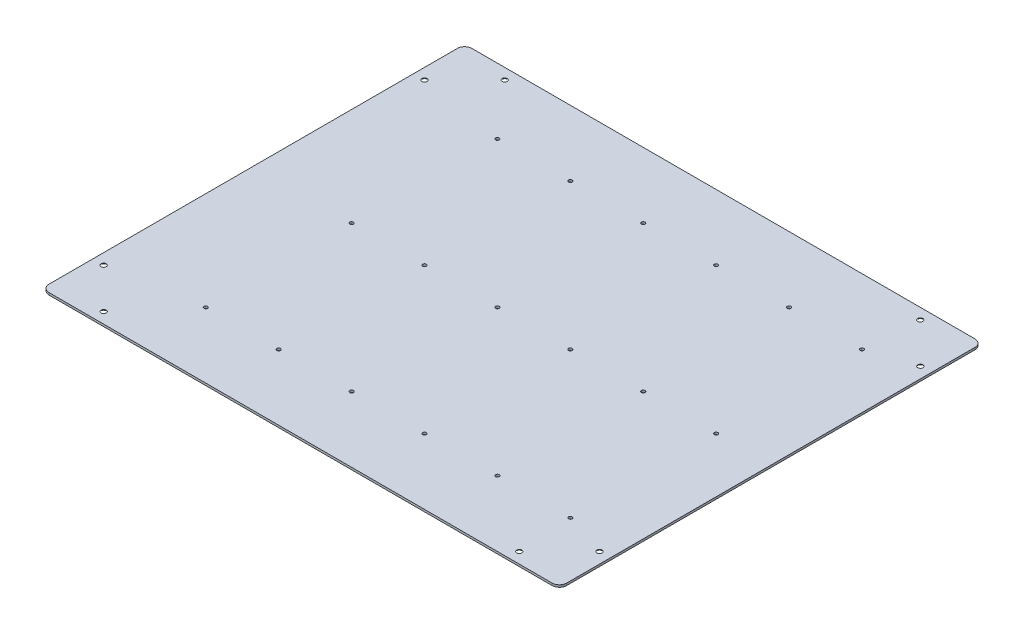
ISO-10303-21;
HEADER;
FILE_DESCRIPTION(('STEP AP214'),'2;1');
FILE_NAME('part.step','',(''),(''),'','','');
FILE_SCHEMA(('AUTOMOTIVE_DESIGN { 1 0 10303 214 1 1 1 1 }'));
ENDSEC;
DATA;
#1=APPLICATION_CONTEXT('core data for automotive mechanical design processes');
#2=APPLICATION_PROTOCOL_DEFINITION('international standard','automotive_design',2000,#1);
#3=PRODUCT_CONTEXT('',#1,'mechanical');
#4=PRODUCT('Part','Part','',(#3));
#5=PRODUCT_RELATED_PRODUCT_CATEGORY('part','',(#4));
#6=PRODUCT_DEFINITION_FORMATION('','',#4);
#7=PRODUCT_DEFINITION_CONTEXT('part definition',#1,'design');
#8=PRODUCT_DEFINITION('design','',#6,#7);
#9=PRODUCT_DEFINITION_SHAPE('','',#8);
#10=(LENGTH_UNIT() NAMED_UNIT(*) SI_UNIT(.MILLI.,.METRE.));
#11=(NAMED_UNIT(*) PLANE_ANGLE_UNIT() SI_UNIT($,.RADIAN.));
#12=(NAMED_UNIT(*) SI_UNIT($,.STERADIAN.) SOLID_ANGLE_UNIT());
#13=UNCERTAINTY_MEASURE_WITH_UNIT(LENGTH_MEASURE(1.E-05),#10,'distance_accuracy_value','');
#14=(GEOMETRIC_REPRESENTATION_CONTEXT(3) GLOBAL_UNCERTAINTY_ASSIGNED_CONTEXT((#13)) GLOBAL_UNIT_ASSIGNED_CONTEXT((#10,
#11,#12)) REPRESENTATION_CONTEXT('',''));
#15=CARTESIAN_POINT('',(0.,0.,0.));
#16=DIRECTION('',(0.,0.,1.));
#17=DIRECTION('',(1.,0.,0.));
#18=AXIS2_PLACEMENT_3D('',#15,#16,#17);
#19=CARTESIAN_POINT('',(280.,3.,-200.));
#20=DIRECTION('',(0.,1.,0.));
#21=DIRECTION('',(0.,0.,1.));
#22=AXIS2_PLACEMENT_3D('',#19,#20,#21);
#23=CYLINDRICAL_SURFACE('',#22,2.5);
#24=CARTESIAN_POINT('',(280.,0.,-200.));
#25=DIRECTION('',(0.,1.,0.));
#26=DIRECTION('',(0.,0.,1.));
#27=AXIS2_PLACEMENT_3D('',#24,#25,#26);
#28=CIRCLE('',#27,2.5);
#29=CARTESIAN_POINT('',(280.,0.,-197.5));
#30=VERTEX_POINT('',#29);
#31=EDGE_CURVE('E290',#30,#30,#28,.T.);
#32=ORIENTED_EDGE('',*,*,#31,.F.);
#33=EDGE_LOOP('',(#32));
#34=FACE_BOUND('',#33,.T.);
#35=CARTESIAN_POINT('',(280.,3.,-200.));
#36=DIRECTION('',(0.,1.,0.));
#37=DIRECTION('',(0.,0.,1.));
#38=AXIS2_PLACEMENT_3D('',#35,#36,#37);
#39=CIRCLE('',#38,2.5);
#40=CARTESIAN_POINT('',(280.,3.,-197.5));
#41=VERTEX_POINT('',#40);
#42=EDGE_CURVE('E294',#41,#41,#39,.T.);
#43=ORIENTED_EDGE('',*,*,#42,.T.);
#44=EDGE_LOOP('',(#43));
#45=FACE_BOUND('',#44,.T.);
#46=ADVANCED_FACE('F69',(#34,#45),#23,.F.);
#47=CARTESIAN_POINT('',(280.,3.,0.));
#48=DIRECTION('',(0.,1.,0.));
#49=DIRECTION('',(0.,0.,1.));
#50=AXIS2_PLACEMENT_3D('',#47,#48,#49);
#51=CYLINDRICAL_SURFACE('',#50,2.5);
#52=CARTESIAN_POINT('',(280.,0.,0.));
#53=DIRECTION('',(0.,1.,0.));
#54=DIRECTION('',(0.,0.,1.));
#55=AXIS2_PLACEMENT_3D('',#52,#53,#54);
#56=CIRCLE('',#55,2.5);
#57=CARTESIAN_POINT('',(280.,0.,2.49999999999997));
#58=VERTEX_POINT('',#57);
#59=EDGE_CURVE('E282',#58,#58,#56,.T.);
#60=ORIENTED_EDGE('',*,*,#59,.F.);
#61=EDGE_LOOP('',(#60));
#62=FACE_BOUND('',#61,.T.);
#63=CARTESIAN_POINT('',(280.,3.,0.));
#64=DIRECTION('',(0.,1.,0.));
#65=DIRECTION('',(0.,0.,1.));
#66=AXIS2_PLACEMENT_3D('',#63,#64,#65);
#67=CIRCLE('',#66,2.5);
#68=CARTESIAN_POINT('',(280.,3.,2.49999999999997));
#69=VERTEX_POINT('',#68);
#70=EDGE_CURVE('E286',#69,#69,#67,.T.);
#71=ORIENTED_EDGE('',*,*,#70,.T.);
#72=EDGE_LOOP('',(#71));
#73=FACE_BOUND('',#72,.T.);
#74=ADVANCED_FACE('F537',(#62,#73),#51,.F.);
#75=CARTESIAN_POINT('',(280.,3.,200.));
#76=DIRECTION('',(0.,1.,0.));
#77=DIRECTION('',(0.,0.,1.));
#78=AXIS2_PLACEMENT_3D('',#75,#76,#77);
#79=CYLINDRICAL_SURFACE('',#78,2.5);
#80=CARTESIAN_POINT('',(280.,0.,200.));
#81=DIRECTION('',(0.,1.,0.));
#82=DIRECTION('',(0.,0.,1.));
#83=AXIS2_PLACEMENT_3D('',#80,#81,#82);
#84=CIRCLE('',#83,2.5);
#85=CARTESIAN_POINT('',(280.,0.,202.5));
#86=VERTEX_POINT('',#85);
#87=EDGE_CURVE('E274',#86,#86,#84,.T.);
#88=ORIENTED_EDGE('',*,*,#87,.F.);
#89=EDGE_LOOP('',(#88));
#90=FACE_BOUND('',#89,.T.);
#91=CARTESIAN_POINT('',(280.,3.,200.));
#92=DIRECTION('',(0.,1.,0.));
#93=DIRECTION('',(0.,0.,1.));
#94=AXIS2_PLACEMENT_3D('',#91,#92,#93);
#95=CIRCLE('',#94,2.5);
#96=CARTESIAN_POINT('',(280.,3.,202.5));
#97=VERTEX_POINT('',#96);
#98=EDGE_CURVE('E278',#97,#97,#95,.T.);
#99=ORIENTED_EDGE('',*,*,#98,.T.);
#100=EDGE_LOOP('',(#99));
#101=FACE_BOUND('',#100,.T.);
#102=ADVANCED_FACE('F543',(#90,#101),#79,.F.);
#103=CARTESIAN_POINT('',(180.,3.,-200.));
#104=DIRECTION('',(0.,1.,0.));
#105=DIRECTION('',(0.,0.,1.));
#106=AXIS2_PLACEMENT_3D('',#103,#104,#105);
#107=CYLINDRICAL_SURFACE('',#106,2.5);
#108=CARTESIAN_POINT('',(180.,0.,-200.));
#109=DIRECTION('',(0.,1.,0.));
#110=DIRECTION('',(0.,0.,1.));
#111=AXIS2_PLACEMENT_3D('',#108,#109,#110);
#112=CIRCLE('',#111,2.5);
#113=CARTESIAN_POINT('',(180.,0.,-197.5));
#114=VERTEX_POINT('',#113);
#115=EDGE_CURVE('E266',#114,#114,#112,.T.);
#116=ORIENTED_EDGE('',*,*,#115,.F.);
#117=EDGE_LOOP('',(#116));
#118=FACE_BOUND('',#117,.T.);
#119=CARTESIAN_POINT('',(180.,3.,-200.));
#120=DIRECTION('',(0.,1.,0.));
#121=DIRECTION('',(0.,0.,1.));
#122=AXIS2_PLACEMENT_3D('',#119,#120,#121);
#123=CIRCLE('',#122,2.5);
#124=CARTESIAN_POINT('',(180.,3.,-197.5));
#125=VERTEX_POINT('',#124);
#126=EDGE_CURVE('E270',#125,#125,#123,.T.);
#127=ORIENTED_EDGE('',*,*,#126,.T.);
#128=EDGE_LOOP('',(#127));
#129=FACE_BOUND('',#128,.T.);
#130=ADVANCED_FACE('F621',(#118,#129),#107,.F.);
#131=CARTESIAN_POINT('',(180.,3.,200.));
#132=DIRECTION('',(0.,1.,0.));
#133=DIRECTION('',(0.,0.,1.));
#134=AXIS2_PLACEMENT_3D('',#131,#132,#133);
#135=CYLINDRICAL_SURFACE('',#134,2.5);
#136=CARTESIAN_POINT('',(180.,0.,200.));
#137=DIRECTION('',(0.,1.,0.));
#138=DIRECTION('',(0.,0.,1.));
#139=AXIS2_PLACEMENT_3D('',#136,#137,#138);
#140=CIRCLE('',#139,2.5);
#141=CARTESIAN_POINT('',(180.,0.,202.5));
#142=VERTEX_POINT('',#141);
#143=EDGE_CURVE('E258',#142,#142,#140,.T.);
#144=ORIENTED_EDGE('',*,*,#143,.F.);
#145=EDGE_LOOP('',(#144));
#146=FACE_BOUND('',#145,.T.);
#147=CARTESIAN_POINT('',(180.,3.,200.));
#148=DIRECTION('',(0.,1.,0.));
#149=DIRECTION('',(0.,0.,1.));
#150=AXIS2_PLACEMENT_3D('',#147,#148,#149);
#151=CIRCLE('',#150,2.5);
#152=CARTESIAN_POINT('',(180.,3.,202.5));
#153=VERTEX_POINT('',#152);
#154=EDGE_CURVE('E262',#153,#153,#151,.T.);
#155=ORIENTED_EDGE('',*,*,#154,.T.);
#156=EDGE_LOOP('',(#155));
#157=FACE_BOUND('',#156,.T.);
#158=ADVANCED_FACE('F617',(#146,#157),#135,.F.);
#159=CARTESIAN_POINT('',(80.,3.,-200.));
#160=DIRECTION('',(0.,1.,0.));
#161=DIRECTION('',(0.,0.,1.));
#162=AXIS2_PLACEMENT_3D('',#159,#160,#161);
#163=CYLINDRICAL_SURFACE('',#162,2.5);
#164=CARTESIAN_POINT('',(80.,0.,-200.));
#165=DIRECTION('',(0.,1.,0.));
#166=DIRECTION('',(0.,0.,1.));
#167=AXIS2_PLACEMENT_3D('',#164,#165,#166);
#168=CIRCLE('',#167,2.5);
#169=CARTESIAN_POINT('',(80.,0.,-197.5));
#170=VERTEX_POINT('',#169);
#171=EDGE_CURVE('E250',#170,#170,#168,.T.);
#172=ORIENTED_EDGE('',*,*,#171,.F.);
#173=EDGE_LOOP('',(#172));
#174=FACE_BOUND('',#173,.T.);
#175=CARTESIAN_POINT('',(80.,3.,-200.));
#176=DIRECTION('',(0.,1.,0.));
#177=DIRECTION('',(0.,0.,1.));
#178=AXIS2_PLACEMENT_3D('',#175,#176,#177);
#179=CIRCLE('',#178,2.5);
#180=CARTESIAN_POINT('',(80.,3.,-197.5));
#181=VERTEX_POINT('',#180);
#182=EDGE_CURVE('E254',#181,#181,#179,.T.);
#183=ORIENTED_EDGE('',*,*,#182,.T.);
#184=EDGE_LOOP('',(#183));
#185=FACE_BOUND('',#184,.T.);
#186=ADVANCED_FACE('F613',(#174,#185),#163,.F.);
#187=CARTESIAN_POINT('',(80.0000000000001,3.,200.));
#188=DIRECTION('',(0.,1.,0.));
#189=DIRECTION('',(0.,0.,1.));
#190=AXIS2_PLACEMENT_3D('',#187,#188,#189);
#191=CYLINDRICAL_SURFACE('',#190,2.5);
#192=CARTESIAN_POINT('',(80.0000000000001,0.,200.));
#193=DIRECTION('',(0.,1.,0.));
#194=DIRECTION('',(0.,0.,1.));
#195=AXIS2_PLACEMENT_3D('',#192,#193,#194);
#196=CIRCLE('',#195,2.5);
#197=CARTESIAN_POINT('',(80.0000000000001,0.,202.5));
#198=VERTEX_POINT('',#197);
#199=EDGE_CURVE('E242',#198,#198,#196,.T.);
#200=ORIENTED_EDGE('',*,*,#199,.F.);
#201=EDGE_LOOP('',(#200));
#202=FACE_BOUND('',#201,.T.);
#203=CARTESIAN_POINT('',(80.0000000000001,3.,200.));
#204=DIRECTION('',(0.,1.,0.));
#205=DIRECTION('',(0.,0.,1.));
#206=AXIS2_PLACEMENT_3D('',#203,#204,#205);
#207=CIRCLE('',#206,2.5);
#208=CARTESIAN_POINT('',(80.0000000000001,3.,202.5));
#209=VERTEX_POINT('',#208);
#210=EDGE_CURVE('E246',#209,#209,#207,.T.);
#211=ORIENTED_EDGE('',*,*,#210,.T.);
#212=EDGE_LOOP('',(#211));
#213=FACE_BOUND('',#212,.T.);
#214=ADVANCED_FACE('F609',(#202,#213),#191,.F.);
#215=CARTESIAN_POINT('',(-20.,3.,-200.));
#216=DIRECTION('',(0.,1.,0.));
#217=DIRECTION('',(0.,0.,1.));
#218=AXIS2_PLACEMENT_3D('',#215,#216,#217);
#219=CYLINDRICAL_SURFACE('',#218,2.5);
#220=CARTESIAN_POINT('',(-20.,0.,-200.));
#221=DIRECTION('',(0.,1.,0.));
#222=DIRECTION('',(0.,0.,1.));
#223=AXIS2_PLACEMENT_3D('',#220,#221,#222);
#224=CIRCLE('',#223,2.5);
#225=CARTESIAN_POINT('',(-20.,0.,-197.5));
#226=VERTEX_POINT('',#225);
#227=EDGE_CURVE('E234',#226,#226,#224,.T.);
#228=ORIENTED_EDGE('',*,*,#227,.F.);
#229=EDGE_LOOP('',(#228));
#230=FACE_BOUND('',#229,.T.);
#231=CARTESIAN_POINT('',(-20.,3.,-200.));
#232=DIRECTION('',(0.,1.,0.));
#233=DIRECTION('',(0.,0.,1.));
#234=AXIS2_PLACEMENT_3D('',#231,#232,#233);
#235=CIRCLE('',#234,2.5);
#236=CARTESIAN_POINT('',(-20.,3.,-197.5));
#237=VERTEX_POINT('',#236);
#238=EDGE_CURVE('E238',#237,#237,#235,.T.);
#239=ORIENTED_EDGE('',*,*,#238,.T.);
#240=EDGE_LOOP('',(#239));
#241=FACE_BOUND('',#240,.T.);
#242=ADVANCED_FACE('F605',(#230,#241),#219,.F.);
#243=CARTESIAN_POINT('',(-19.9999999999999,3.,200.));
#244=DIRECTION('',(0.,1.,0.));
#245=DIRECTION('',(0.,0.,1.));
#246=AXIS2_PLACEMENT_3D('',#243,#244,#245);
#247=CYLINDRICAL_SURFACE('',#246,2.5);
#248=CARTESIAN_POINT('',(-19.9999999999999,0.,200.));
#249=DIRECTION('',(0.,1.,0.));
#250=DIRECTION('',(0.,0.,1.));
#251=AXIS2_PLACEMENT_3D('',#248,#249,#250);
#252=CIRCLE('',#251,2.5);
#253=CARTESIAN_POINT('',(-19.9999999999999,0.,202.5));
#254=VERTEX_POINT('',#253);
#255=EDGE_CURVE('E226',#254,#254,#252,.T.);
#256=ORIENTED_EDGE('',*,*,#255,.F.);
#257=EDGE_LOOP('',(#256));
#258=FACE_BOUND('',#257,.T.);
#259=CARTESIAN_POINT('',(-19.9999999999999,3.,200.));
#260=DIRECTION('',(0.,1.,0.));
#261=DIRECTION('',(0.,0.,1.));
#262=AXIS2_PLACEMENT_3D('',#259,#260,#261);
#263=CIRCLE('',#262,2.5);
#264=CARTESIAN_POINT('',(-19.9999999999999,3.,202.5));
#265=VERTEX_POINT('',#264);
#266=EDGE_CURVE('E230',#265,#265,#263,.T.);
#267=ORIENTED_EDGE('',*,*,#266,.T.);
#268=EDGE_LOOP('',(#267));
#269=FACE_BOUND('',#268,.T.);
#270=ADVANCED_FACE('F601',(#258,#269),#247,.F.);
#271=CARTESIAN_POINT('',(-120.,3.,-200.));
#272=DIRECTION('',(0.,1.,0.));
#273=DIRECTION('',(0.,0.,1.));
#274=AXIS2_PLACEMENT_3D('',#271,#272,#273);
#275=CYLINDRICAL_SURFACE('',#274,2.5);
#276=CARTESIAN_POINT('',(-120.,0.,-200.));
#277=DIRECTION('',(0.,1.,0.));
#278=DIRECTION('',(0.,0.,1.));
#279=AXIS2_PLACEMENT_3D('',#276,#277,#278);
#280=CIRCLE('',#279,2.5);
#281=CARTESIAN_POINT('',(-120.,0.,-197.5));
#282=VERTEX_POINT('',#281);
#283=EDGE_CURVE('E218',#282,#282,#280,.T.);
#284=ORIENTED_EDGE('',*,*,#283,.F.);
#285=EDGE_LOOP('',(#284));
#286=FACE_BOUND('',#285,.T.);
#287=CARTESIAN_POINT('',(-120.,3.,-200.));
#288=DIRECTION('',(0.,1.,0.));
#289=DIRECTION('',(0.,0.,1.));
#290=AXIS2_PLACEMENT_3D('',#287,#288,#289);
#291=CIRCLE('',#290,2.5);
#292=CARTESIAN_POINT('',(-120.,3.,-197.5));
#293=VERTEX_POINT('',#292);
#294=EDGE_CURVE('E222',#293,#293,#291,.T.);
#295=ORIENTED_EDGE('',*,*,#294,.T.);
#296=EDGE_LOOP('',(#295));
#297=FACE_BOUND('',#296,.T.);
#298=ADVANCED_FACE('F597',(#286,#297),#275,.F.);
#299=CARTESIAN_POINT('',(-120.,3.,200.));
#300=DIRECTION('',(0.,1.,0.));
#301=DIRECTION('',(0.,0.,1.));
#302=AXIS2_PLACEMENT_3D('',#299,#300,#301);
#303=CYLINDRICAL_SURFACE('',#302,2.5);
#304=CARTESIAN_POINT('',(-120.,0.,200.));
#305=DIRECTION('',(0.,1.,0.));
#306=DIRECTION('',(0.,0.,1.));
#307=AXIS2_PLACEMENT_3D('',#304,#305,#306);
#308=CIRCLE('',#307,2.5);
#309=CARTESIAN_POINT('',(-120.,0.,202.5));
#310=VERTEX_POINT('',#309);
#311=EDGE_CURVE('E210',#310,#310,#308,.T.);
#312=ORIENTED_EDGE('',*,*,#311,.F.);
#313=EDGE_LOOP('',(#312));
#314=FACE_BOUND('',#313,.T.);
#315=CARTESIAN_POINT('',(-120.,3.,200.));
#316=DIRECTION('',(0.,1.,0.));
#317=DIRECTION('',(0.,0.,1.));
#318=AXIS2_PLACEMENT_3D('',#315,#316,#317);
#319=CIRCLE('',#318,2.5);
#320=CARTESIAN_POINT('',(-120.,3.,202.5));
#321=VERTEX_POINT('',#320);
#322=EDGE_CURVE('E214',#321,#321,#319,.T.);
#323=ORIENTED_EDGE('',*,*,#322,.T.);
#324=EDGE_LOOP('',(#323));
#325=FACE_BOUND('',#324,.T.);
#326=ADVANCED_FACE('F593',(#314,#325),#303,.F.);
#327=CARTESIAN_POINT('',(-220.,3.,-200.));
#328=DIRECTION('',(0.,1.,0.));
#329=DIRECTION('',(0.,0.,1.));
#330=AXIS2_PLACEMENT_3D('',#327,#328,#329);
#331=CYLINDRICAL_SURFACE('',#330,2.5);
#332=CARTESIAN_POINT('',(-220.,0.,-200.));
#333=DIRECTION('',(0.,1.,0.));
#334=DIRECTION('',(0.,0.,1.));
#335=AXIS2_PLACEMENT_3D('',#332,#333,#334);
#336=CIRCLE('',#335,2.5);
#337=CARTESIAN_POINT('',(-220.,0.,-197.5));
#338=VERTEX_POINT('',#337);
#339=EDGE_CURVE('E202',#338,#338,#336,.T.);
#340=ORIENTED_EDGE('',*,*,#339,.F.);
#341=EDGE_LOOP('',(#340));
#342=FACE_BOUND('',#341,.T.);
#343=CARTESIAN_POINT('',(-220.,3.,-200.));
#344=DIRECTION('',(0.,1.,0.));
#345=DIRECTION('',(0.,0.,1.));
#346=AXIS2_PLACEMENT_3D('',#343,#344,#345);
#347=CIRCLE('',#346,2.5);
#348=CARTESIAN_POINT('',(-220.,3.,-197.5));
#349=VERTEX_POINT('',#348);
#350=EDGE_CURVE('E206',#349,#349,#347,.T.);
#351=ORIENTED_EDGE('',*,*,#350,.T.);
#352=EDGE_LOOP('',(#351));
#353=FACE_BOUND('',#352,.T.);
#354=ADVANCED_FACE('F589',(#342,#353),#331,.F.);
#355=CARTESIAN_POINT('',(180.,3.,0.));
#356=DIRECTION('',(0.,1.,0.));
#357=DIRECTION('',(0.,0.,1.));
#358=AXIS2_PLACEMENT_3D('',#355,#356,#357);
#359=CYLINDRICAL_SURFACE('',#358,2.5);
#360=CARTESIAN_POINT('',(180.,0.,0.));
#361=DIRECTION('',(0.,1.,0.));
#362=DIRECTION('',(0.,0.,1.));
#363=AXIS2_PLACEMENT_3D('',#360,#361,#362);
#364=CIRCLE('',#363,2.5);
#365=CARTESIAN_POINT('',(180.,0.,2.49999999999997));
#366=VERTEX_POINT('',#365);
#367=EDGE_CURVE('E194',#366,#366,#364,.T.);
#368=ORIENTED_EDGE('',*,*,#367,.F.);
#369=EDGE_LOOP('',(#368));
#370=FACE_BOUND('',#369,.T.);
#371=CARTESIAN_POINT('',(180.,3.,0.));
#372=DIRECTION('',(0.,1.,0.));
#373=DIRECTION('',(0.,0.,1.));
#374=AXIS2_PLACEMENT_3D('',#371,#372,#373);
#375=CIRCLE('',#374,2.5);
#376=CARTESIAN_POINT('',(180.,3.,2.49999999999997));
#377=VERTEX_POINT('',#376);
#378=EDGE_CURVE('E198',#377,#377,#375,.T.);
#379=ORIENTED_EDGE('',*,*,#378,.T.);
#380=EDGE_LOOP('',(#379));
#381=FACE_BOUND('',#380,.T.);
#382=ADVANCED_FACE('F585',(#370,#381),#359,.F.);
#383=CARTESIAN_POINT('',(80.,3.,0.));
#384=DIRECTION('',(0.,1.,0.));
#385=DIRECTION('',(0.,0.,1.));
#386=AXIS2_PLACEMENT_3D('',#383,#384,#385);
#387=CYLINDRICAL_SURFACE('',#386,2.5);
#388=CARTESIAN_POINT('',(80.,0.,0.));
#389=DIRECTION('',(0.,1.,0.));
#390=DIRECTION('',(0.,0.,1.));
#391=AXIS2_PLACEMENT_3D('',#388,#389,#390);
#392=CIRCLE('',#391,2.5);
#393=CARTESIAN_POINT('',(80.,0.,2.49999999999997));
#394=VERTEX_POINT('',#393);
#395=EDGE_CURVE('E186',#394,#394,#392,.T.);
#396=ORIENTED_EDGE('',*,*,#395,.F.);
#397=EDGE_LOOP('',(#396));
#398=FACE_BOUND('',#397,.T.);
#399=CARTESIAN_POINT('',(80.,3.,0.));
#400=DIRECTION('',(0.,1.,0.));
#401=DIRECTION('',(0.,0.,1.));
#402=AXIS2_PLACEMENT_3D('',#399,#400,#401);
#403=CIRCLE('',#402,2.5);
#404=CARTESIAN_POINT('',(80.,3.,2.49999999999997));
#405=VERTEX_POINT('',#404);
#406=EDGE_CURVE('E190',#405,#405,#403,.T.);
#407=ORIENTED_EDGE('',*,*,#406,.T.);
#408=EDGE_LOOP('',(#407));
#409=FACE_BOUND('',#408,.T.);
#410=ADVANCED_FACE('F581',(#398,#409),#387,.F.);
#411=CARTESIAN_POINT('',(-20.,3.,0.));
#412=DIRECTION('',(0.,1.,0.));
#413=DIRECTION('',(0.,0.,1.));
#414=AXIS2_PLACEMENT_3D('',#411,#412,#413);
#415=CYLINDRICAL_SURFACE('',#414,2.5);
#416=CARTESIAN_POINT('',(-20.,0.,0.));
#417=DIRECTION('',(0.,1.,0.));
#418=DIRECTION('',(0.,0.,1.));
#419=AXIS2_PLACEMENT_3D('',#416,#417,#418);
#420=CIRCLE('',#419,2.5);
#421=CARTESIAN_POINT('',(-20.,0.,2.49999999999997));
#422=VERTEX_POINT('',#421);
#423=EDGE_CURVE('E177',#422,#422,#420,.T.);
#424=ORIENTED_EDGE('',*,*,#423,.F.);
#425=EDGE_LOOP('',(#424));
#426=FACE_BOUND('',#425,.T.);
#427=CARTESIAN_POINT('',(-20.,3.,0.));
#428=DIRECTION('',(0.,1.,0.));
#429=DIRECTION('',(0.,0.,1.));
#430=AXIS2_PLACEMENT_3D('',#427,#428,#429);
#431=CIRCLE('',#430,2.5);
#432=CARTESIAN_POINT('',(-20.,3.,2.49999999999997));
#433=VERTEX_POINT('',#432);
#434=EDGE_CURVE('E181',#433,#433,#431,.T.);
#435=ORIENTED_EDGE('',*,*,#434,.T.);
#436=EDGE_LOOP('',(#435));
#437=FACE_BOUND('',#436,.T.);
#438=ADVANCED_FACE('F575',(#426,#437),#415,.F.);
#439=CARTESIAN_POINT('',(355.,3.,-290.));
#440=DIRECTION('',(-1.,0.,0.));
#441=DIRECTION('',(0.,0.,1.));
#442=AXIS2_PLACEMENT_3D('',#439,#440,#441);
#443=PLANE('',#442);
#444=DIRECTION('',(0.,0.,-1.));
#445=VECTOR('',#444,1.);
#446=CARTESIAN_POINT('',(355.,0.,-290.));
#447=LINE('',#446,#445);
#448=CARTESIAN_POINT('',(355.,0.,280.));
#449=VERTEX_POINT('',#448);
#450=CARTESIAN_POINT('',(355.,0.,-280.));
#451=VERTEX_POINT('',#450);
#452=EDGE_CURVE('E173',#449,#451,#447,.T.);
#453=ORIENTED_EDGE('',*,*,#452,.T.);
#454=DIRECTION('',(0.,-1.,0.));
#455=VECTOR('',#454,1.);
#456=CARTESIAN_POINT('',(355.,3.,-280.));
#457=LINE('',#456,#455);
#458=CARTESIAN_POINT('',(355.,3.,-280.));
#459=VERTEX_POINT('',#458);
#460=EDGE_CURVE('E326',#451,#459,#457,.F.);
#461=ORIENTED_EDGE('',*,*,#460,.T.);
#462=DIRECTION('',(0.,0.,-1.));
#463=VECTOR('',#462,1.);
#464=CARTESIAN_POINT('',(355.,3.,-290.));
#465=LINE('',#464,#463);
#466=CARTESIAN_POINT('',(355.,3.,280.));
#467=VERTEX_POINT('',#466);
#468=EDGE_CURVE('E171',#467,#459,#465,.T.);
#469=ORIENTED_EDGE('',*,*,#468,.F.);
#470=DIRECTION('',(0.,-1.,0.));
#471=VECTOR('',#470,1.);
#472=CARTESIAN_POINT('',(355.,3.,280.));
#473=LINE('',#472,#471);
#474=EDGE_CURVE('E322',#467,#449,#473,.T.);
#475=ORIENTED_EDGE('',*,*,#474,.T.);
#476=EDGE_LOOP('',(#453,#461,#469,#475));
#477=FACE_BOUND('',#476,.T.);
#478=ADVANCED_FACE('F564',(#477),#443,.F.);
#479=CARTESIAN_POINT('',(-355.,3.,-290.));
#480=DIRECTION('',(0.,0.,1.));
#481=DIRECTION('',(1.,0.,0.));
#482=AXIS2_PLACEMENT_3D('',#479,#480,#481);
#483=PLANE('',#482);
#484=DIRECTION('',(-1.,0.,0.));
#485=VECTOR('',#484,1.);
#486=CARTESIAN_POINT('',(-355.,0.,-290.));
#487=LINE('',#486,#485);
#488=CARTESIAN_POINT('',(345.,0.,-290.));
#489=VERTEX_POINT('',#488);
#490=CARTESIAN_POINT('',(-345.,0.,-290.));
#491=VERTEX_POINT('',#490);
#492=EDGE_CURVE('E167',#489,#491,#487,.T.);
#493=ORIENTED_EDGE('',*,*,#492,.T.);
#494=DIRECTION('',(0.,-1.,0.));
#495=VECTOR('',#494,1.);
#496=CARTESIAN_POINT('',(-345.,3.,-290.));
#497=LINE('',#496,#495);
#498=CARTESIAN_POINT('',(-345.,3.,-290.));
#499=VERTEX_POINT('',#498);
#500=EDGE_CURVE('E141',#491,#499,#497,.F.);
#501=ORIENTED_EDGE('',*,*,#500,.T.);
#502=DIRECTION('',(-1.,0.,0.));
#503=VECTOR('',#502,1.);
#504=CARTESIAN_POINT('',(-355.,3.,-290.));
#505=LINE('',#504,#503);
#506=CARTESIAN_POINT('',(345.,3.,-290.));
#507=VERTEX_POINT('',#506);
#508=EDGE_CURVE('E333',#507,#499,#505,.T.);
#509=ORIENTED_EDGE('',*,*,#508,.F.);
#510=DIRECTION('',(0.,-1.,0.));
#511=VECTOR('',#510,1.);
#512=CARTESIAN_POINT('',(345.,3.,-290.));
#513=LINE('',#512,#511);
#514=EDGE_CURVE('E147',#507,#489,#513,.T.);
#515=ORIENTED_EDGE('',*,*,#514,.T.);
#516=EDGE_LOOP('',(#493,#501,#509,#515));
#517=FACE_BOUND('',#516,.T.);
#518=ADVANCED_FACE('F567',(#517),#483,.F.);
#519=CARTESIAN_POINT('',(-355.,3.,-290.));
#520=DIRECTION('',(1.,0.,0.));
#521=DIRECTION('',(0.,0.,-1.));
#522=AXIS2_PLACEMENT_3D('',#519,#520,#521);
#523=PLANE('',#522);
#524=DIRECTION('',(0.,0.,1.));
#525=VECTOR('',#524,1.);
#526=CARTESIAN_POINT('',(-355.,3.,-290.));
#527=LINE('',#526,#525);
#528=CARTESIAN_POINT('',(-355.,3.,-280.));
#529=VERTEX_POINT('',#528);
#530=CARTESIAN_POINT('',(-355.,3.,280.));
#531=VERTEX_POINT('',#530);
#532=EDGE_CURVE('E156',#529,#531,#527,.T.);
#533=ORIENTED_EDGE('',*,*,#532,.F.);
#534=DIRECTION('',(0.,-1.,0.));
#535=VECTOR('',#534,1.);
#536=CARTESIAN_POINT('',(-355.,3.,-280.));
#537=LINE('',#536,#535);
#538=CARTESIAN_POINT('',(-355.,0.,-280.));
#539=VERTEX_POINT('',#538);
#540=EDGE_CURVE('E140',#529,#539,#537,.T.);
#541=ORIENTED_EDGE('',*,*,#540,.T.);
#542=DIRECTION('',(0.,0.,1.));
#543=VECTOR('',#542,1.);
#544=CARTESIAN_POINT('',(-355.,0.,-290.));
#545=LINE('',#544,#543);
#546=CARTESIAN_POINT('',(-355.,0.,280.));
#547=VERTEX_POINT('',#546);
#548=EDGE_CURVE('E154',#539,#547,#545,.T.);
#549=ORIENTED_EDGE('',*,*,#548,.T.);
#550=DIRECTION('',(0.,-1.,0.));
#551=VECTOR('',#550,1.);
#552=CARTESIAN_POINT('',(-355.,3.,280.));
#553=LINE('',#552,#551);
#554=EDGE_CURVE('E159',#547,#531,#553,.F.);
#555=ORIENTED_EDGE('',*,*,#554,.T.);
#556=EDGE_LOOP('',(#533,#541,#549,#555));
#557=FACE_BOUND('',#556,.T.);
#558=ADVANCED_FACE('F153',(#557),#523,.F.);
#559=CARTESIAN_POINT('',(-355.,3.,290.));
#560=DIRECTION('',(0.,0.,-1.));
#561=DIRECTION('',(-1.,0.,0.));
#562=AXIS2_PLACEMENT_3D('',#559,#560,#561);
#563=PLANE('',#562);
#564=DIRECTION('',(1.,0.,0.));
#565=VECTOR('',#564,1.);
#566=CARTESIAN_POINT('',(-355.,3.,290.));
#567=LINE('',#566,#565);
#568=CARTESIAN_POINT('',(-345.,3.,290.));
#569=VERTEX_POINT('',#568);
#570=CARTESIAN_POINT('',(345.,3.,290.));
#571=VERTEX_POINT('',#570);
#572=EDGE_CURVE('E182',#569,#571,#567,.T.);
#573=ORIENTED_EDGE('',*,*,#572,.F.);
#574=DIRECTION('',(0.,-1.,0.));
#575=VECTOR('',#574,1.);
#576=CARTESIAN_POINT('',(-345.,3.,290.));
#577=LINE('',#576,#575);
#578=CARTESIAN_POINT('',(-345.,0.,290.));
#579=VERTEX_POINT('',#578);
#580=EDGE_CURVE('E12',#569,#579,#577,.T.);
#581=ORIENTED_EDGE('',*,*,#580,.T.);
#582=DIRECTION('',(1.,0.,0.));
#583=VECTOR('',#582,1.);
#584=CARTESIAN_POINT('',(-355.,0.,290.));
#585=LINE('',#584,#583);
#586=CARTESIAN_POINT('',(345.,0.,290.));
#587=VERTEX_POINT('',#586);
#588=EDGE_CURVE('E166',#579,#587,#585,.T.);
#589=ORIENTED_EDGE('',*,*,#588,.T.);
#590=DIRECTION('',(0.,-1.,0.));
#591=VECTOR('',#590,1.);
#592=CARTESIAN_POINT('',(345.,3.,290.));
#593=LINE('',#592,#591);
#594=EDGE_CURVE('E78',#587,#571,#593,.F.);
#595=ORIENTED_EDGE('',*,*,#594,.T.);
#596=EDGE_LOOP('',(#573,#581,#589,#595));
#597=FACE_BOUND('',#596,.T.);
#598=ADVANCED_FACE('F485',(#597),#563,.F.);
#599=CARTESIAN_POINT('',(0.,3.,0.));
#600=DIRECTION('',(0.,1.,0.));
#601=DIRECTION('',(0.,0.,1.));
#602=AXIS2_PLACEMENT_3D('',#599,#600,#601);
#603=PLANE('',#602);
#604=CARTESIAN_POINT('',(-220.,3.,0.));
#605=DIRECTION('',(0.,1.,0.));
#606=DIRECTION('',(0.,0.,1.));
#607=AXIS2_PLACEMENT_3D('',#604,#605,#606);
#608=CIRCLE('',#607,2.5);
#609=CARTESIAN_POINT('',(-220.,3.,2.49999999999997));
#610=VERTEX_POINT('',#609);
#611=EDGE_CURVE('E464',#610,#610,#608,.T.);
#612=ORIENTED_EDGE('',*,*,#611,.F.);
#613=EDGE_LOOP('',(#612));
#614=FACE_BOUND('',#613,.T.);
#615=CARTESIAN_POINT('',(-120.,3.,0.));
#616=DIRECTION('',(0.,1.,0.));
#617=DIRECTION('',(0.,0.,1.));
#618=AXIS2_PLACEMENT_3D('',#615,#616,#617);
#619=CIRCLE('',#618,2.5);
#620=CARTESIAN_POINT('',(-120.,3.,2.49999999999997));
#621=VERTEX_POINT('',#620);
#622=EDGE_CURVE('E456',#621,#621,#619,.T.);
#623=ORIENTED_EDGE('',*,*,#622,.F.);
#624=EDGE_LOOP('',(#623));
#625=FACE_BOUND('',#624,.T.);
#626=CARTESIAN_POINT('',(-220.,3.,200.));
#627=DIRECTION('',(0.,1.,0.));
#628=DIRECTION('',(0.,0.,1.));
#629=AXIS2_PLACEMENT_3D('',#626,#627,#628);
#630=CIRCLE('',#629,2.5);
#631=CARTESIAN_POINT('',(-220.,3.,202.5));
#632=VERTEX_POINT('',#631);
#633=EDGE_CURVE('E452',#632,#632,#630,.T.);
#634=ORIENTED_EDGE('',*,*,#633,.F.);
#635=EDGE_LOOP('',(#634));
#636=FACE_BOUND('',#635,.T.);
#637=CARTESIAN_POINT('',(285.,3.,-275.));
#638=DIRECTION('',(0.,-1.,0.));
#639=DIRECTION('',(0.,0.,-1.));
#640=AXIS2_PLACEMENT_3D('',#637,#638,#639);
#641=CIRCLE('',#640,3.5);
#642=CARTESIAN_POINT('',(285.,3.,-278.5));
#643=VERTEX_POINT('',#642);
#644=EDGE_CURVE('E436',#643,#643,#641,.T.);
#645=ORIENTED_EDGE('',*,*,#644,.T.);
#646=EDGE_LOOP('',(#645));
#647=FACE_BOUND('',#646,.T.);
#648=CARTESIAN_POINT('',(340.,3.,-220.));
#649=DIRECTION('',(0.,-1.,0.));
#650=DIRECTION('',(0.,0.,-1.));
#651=AXIS2_PLACEMENT_3D('',#648,#649,#650);
#652=CIRCLE('',#651,3.5);
#653=CARTESIAN_POINT('',(340.,3.,-223.5));
#654=VERTEX_POINT('',#653);
#655=EDGE_CURVE('E424',#654,#654,#652,.T.);
#656=ORIENTED_EDGE('',*,*,#655,.T.);
#657=EDGE_LOOP('',(#656));
#658=FACE_BOUND('',#657,.T.);
#659=CARTESIAN_POINT('',(340.,3.,220.));
#660=DIRECTION('',(0.,-1.,0.));
#661=DIRECTION('',(0.,0.,-1.));
#662=AXIS2_PLACEMENT_3D('',#659,#660,#661);
#663=CIRCLE('',#662,3.5);
#664=CARTESIAN_POINT('',(340.,3.,216.5));
#665=VERTEX_POINT('',#664);
#666=EDGE_CURVE('E412',#665,#665,#663,.T.);
#667=ORIENTED_EDGE('',*,*,#666,.T.);
#668=EDGE_LOOP('',(#667));
#669=FACE_BOUND('',#668,.T.);
#670=CARTESIAN_POINT('',(285.,3.,275.));
#671=DIRECTION('',(0.,-1.,0.));
#672=DIRECTION('',(0.,0.,-1.));
#673=AXIS2_PLACEMENT_3D('',#670,#671,#672);
#674=CIRCLE('',#673,3.5);
#675=CARTESIAN_POINT('',(285.,3.,271.5));
#676=VERTEX_POINT('',#675);
#677=EDGE_CURVE('E400',#676,#676,#674,.T.);
#678=ORIENTED_EDGE('',*,*,#677,.T.);
#679=EDGE_LOOP('',(#678));
#680=FACE_BOUND('',#679,.T.);
#681=CARTESIAN_POINT('',(-285.,3.,275.));
#682=DIRECTION('',(0.,-1.,0.));
#683=DIRECTION('',(0.,0.,-1.));
#684=AXIS2_PLACEMENT_3D('',#681,#682,#683);
#685=CIRCLE('',#684,3.5);
#686=CARTESIAN_POINT('',(-285.,3.,271.5));
#687=VERTEX_POINT('',#686);
#688=EDGE_CURVE('E388',#687,#687,#685,.T.);
#689=ORIENTED_EDGE('',*,*,#688,.T.);
#690=EDGE_LOOP('',(#689));
#691=FACE_BOUND('',#690,.T.);
#692=CARTESIAN_POINT('',(-340.,3.,220.));
#693=DIRECTION('',(0.,-1.,0.));
#694=DIRECTION('',(0.,0.,-1.));
#695=AXIS2_PLACEMENT_3D('',#692,#693,#694);
#696=CIRCLE('',#695,3.5);
#697=CARTESIAN_POINT('',(-340.,3.,216.5));
#698=VERTEX_POINT('',#697);
#699=EDGE_CURVE('E376',#698,#698,#696,.T.);
#700=ORIENTED_EDGE('',*,*,#699,.T.);
#701=EDGE_LOOP('',(#700));
#702=FACE_BOUND('',#701,.T.);
#703=CARTESIAN_POINT('',(-340.,3.,-220.));
#704=DIRECTION('',(0.,-1.,0.));
#705=DIRECTION('',(0.,0.,-1.));
#706=AXIS2_PLACEMENT_3D('',#703,#704,#705);
#707=CIRCLE('',#706,3.5);
#708=CARTESIAN_POINT('',(-340.,3.,-223.5));
#709=VERTEX_POINT('',#708);
#710=EDGE_CURVE('E362',#709,#709,#707,.T.);
#711=ORIENTED_EDGE('',*,*,#710,.T.);
#712=EDGE_LOOP('',(#711));
#713=FACE_BOUND('',#712,.T.);
#714=CARTESIAN_POINT('',(-285.,3.,-275.));
#715=DIRECTION('',(0.,-1.,0.));
#716=DIRECTION('',(0.,0.,-1.));
#717=AXIS2_PLACEMENT_3D('',#714,#715,#716);
#718=CIRCLE('',#717,3.5);
#719=CARTESIAN_POINT('',(-285.,3.,-278.5));
#720=VERTEX_POINT('',#719);
#721=EDGE_CURVE('E343',#720,#720,#718,.T.);
#722=ORIENTED_EDGE('',*,*,#721,.T.);
#723=EDGE_LOOP('',(#722));
#724=FACE_BOUND('',#723,.T.);
#725=ORIENTED_EDGE('',*,*,#508,.T.);
#726=CARTESIAN_POINT('',(-345.,3.,-280.));
#727=DIRECTION('',(0.,1.,0.));
#728=DIRECTION('',(0.,0.,1.));
#729=AXIS2_PLACEMENT_3D('',#726,#727,#728);
#730=CIRCLE('',#729,10.);
#731=EDGE_CURVE('E319',#499,#529,#730,.T.);
#732=ORIENTED_EDGE('',*,*,#731,.T.);
#733=ORIENTED_EDGE('',*,*,#532,.T.);
#734=CARTESIAN_POINT('',(-345.,3.,280.));
#735=DIRECTION('',(0.,1.,0.));
#736=DIRECTION('',(0.,0.,1.));
#737=AXIS2_PLACEMENT_3D('',#734,#735,#736);
#738=CIRCLE('',#737,10.);
#739=EDGE_CURVE('E91',#531,#569,#738,.T.);
#740=ORIENTED_EDGE('',*,*,#739,.T.);
#741=ORIENTED_EDGE('',*,*,#572,.T.);
#742=CARTESIAN_POINT('',(345.,3.,280.));
#743=DIRECTION('',(0.,1.,0.));
#744=DIRECTION('',(0.,0.,1.));
#745=AXIS2_PLACEMENT_3D('',#742,#743,#744);
#746=CIRCLE('',#745,10.);
#747=EDGE_CURVE('E311',#571,#467,#746,.T.);
#748=ORIENTED_EDGE('',*,*,#747,.T.);
#749=ORIENTED_EDGE('',*,*,#468,.T.);
#750=CARTESIAN_POINT('',(345.,3.,-280.));
#751=DIRECTION('',(0.,1.,0.));
#752=DIRECTION('',(0.,0.,1.));
#753=AXIS2_PLACEMENT_3D('',#750,#751,#752);
#754=CIRCLE('',#753,10.);
#755=EDGE_CURVE('E316',#459,#507,#754,.T.);
#756=ORIENTED_EDGE('',*,*,#755,.T.);
#757=EDGE_LOOP('',(#725,#732,#733,#740,#741,#748,#749,#756));
#758=FACE_BOUND('',#757,.T.);
#759=ORIENTED_EDGE('',*,*,#434,.F.);
#760=EDGE_LOOP('',(#759));
#761=FACE_BOUND('',#760,.T.);
#762=ORIENTED_EDGE('',*,*,#406,.F.);
#763=EDGE_LOOP('',(#762));
#764=FACE_BOUND('',#763,.T.);
#765=ORIENTED_EDGE('',*,*,#378,.F.);
#766=EDGE_LOOP('',(#765));
#767=FACE_BOUND('',#766,.T.);
#768=ORIENTED_EDGE('',*,*,#350,.F.);
#769=EDGE_LOOP('',(#768));
#770=FACE_BOUND('',#769,.T.);
#771=ORIENTED_EDGE('',*,*,#322,.F.);
#772=EDGE_LOOP('',(#771));
#773=FACE_BOUND('',#772,.T.);
#774=ORIENTED_EDGE('',*,*,#294,.F.);
#775=EDGE_LOOP('',(#774));
#776=FACE_BOUND('',#775,.T.);
#777=ORIENTED_EDGE('',*,*,#266,.F.);
#778=EDGE_LOOP('',(#777));
#779=FACE_BOUND('',#778,.T.);
#780=ORIENTED_EDGE('',*,*,#238,.F.);
#781=EDGE_LOOP('',(#780));
#782=FACE_BOUND('',#781,.T.);
#783=ORIENTED_EDGE('',*,*,#210,.F.);
#784=EDGE_LOOP('',(#783));
#785=FACE_BOUND('',#784,.T.);
#786=ORIENTED_EDGE('',*,*,#182,.F.);
#787=EDGE_LOOP('',(#786));
#788=FACE_BOUND('',#787,.T.);
#789=ORIENTED_EDGE('',*,*,#154,.F.);
#790=EDGE_LOOP('',(#789));
#791=FACE_BOUND('',#790,.T.);
#792=ORIENTED_EDGE('',*,*,#126,.F.);
#793=EDGE_LOOP('',(#792));
#794=FACE_BOUND('',#793,.T.);
#795=ORIENTED_EDGE('',*,*,#98,.F.);
#796=EDGE_LOOP('',(#795));
#797=FACE_BOUND('',#796,.T.);
#798=ORIENTED_EDGE('',*,*,#70,.F.);
#799=EDGE_LOOP('',(#798));
#800=FACE_BOUND('',#799,.T.);
#801=ORIENTED_EDGE('',*,*,#42,.F.);
#802=EDGE_LOOP('',(#801));
#803=FACE_BOUND('',#802,.T.);
#804=ADVANCED_FACE('F482',(#614,#625,#636,#647,#658,#669,#680,#691,#702,#713,#724,#758,#761,
#764,#767,#770,#773,#776,#779,#782,#785,#788,#791,#794,#797,#800,#803),#603,.T.);
#805=CARTESIAN_POINT('',(0.,0.,0.));
#806=DIRECTION('',(0.,1.,0.));
#807=DIRECTION('',(0.,0.,1.));
#808=AXIS2_PLACEMENT_3D('',#805,#806,#807);
#809=PLANE('',#808);
#810=CARTESIAN_POINT('',(-220.,0.,0.));
#811=DIRECTION('',(0.,1.,0.));
#812=DIRECTION('',(0.,0.,1.));
#813=AXIS2_PLACEMENT_3D('',#810,#811,#812);
#814=CIRCLE('',#813,2.5);
#815=CARTESIAN_POINT('',(-220.,0.,2.49999999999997));
#816=VERTEX_POINT('',#815);
#817=EDGE_CURVE('E468',#816,#816,#814,.T.);
#818=ORIENTED_EDGE('',*,*,#817,.T.);
#819=EDGE_LOOP('',(#818));
#820=FACE_BOUND('',#819,.T.);
#821=CARTESIAN_POINT('',(-120.,0.,0.));
#822=DIRECTION('',(0.,1.,0.));
#823=DIRECTION('',(0.,0.,1.));
#824=AXIS2_PLACEMENT_3D('',#821,#822,#823);
#825=CIRCLE('',#824,2.5);
#826=CARTESIAN_POINT('',(-120.,0.,2.49999999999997));
#827=VERTEX_POINT('',#826);
#828=EDGE_CURVE('E460',#827,#827,#825,.T.);
#829=ORIENTED_EDGE('',*,*,#828,.T.);
#830=EDGE_LOOP('',(#829));
#831=FACE_BOUND('',#830,.T.);
#832=CARTESIAN_POINT('',(-220.,0.,200.));
#833=DIRECTION('',(0.,1.,0.));
#834=DIRECTION('',(0.,0.,1.));
#835=AXIS2_PLACEMENT_3D('',#832,#833,#834);
#836=CIRCLE('',#835,2.5);
#837=CARTESIAN_POINT('',(-220.,0.,202.5));
#838=VERTEX_POINT('',#837);
#839=EDGE_CURVE('E448',#838,#838,#836,.T.);
#840=ORIENTED_EDGE('',*,*,#839,.T.);
#841=EDGE_LOOP('',(#840));
#842=FACE_BOUND('',#841,.T.);
#843=CARTESIAN_POINT('',(285.,0.,-275.));
#844=DIRECTION('',(0.,-1.,0.));
#845=DIRECTION('',(0.,0.,-1.));
#846=AXIS2_PLACEMENT_3D('',#843,#844,#845);
#847=CIRCLE('',#846,6.40000000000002);
#848=CARTESIAN_POINT('',(285.,0.,-281.4));
#849=VERTEX_POINT('',#848);
#850=EDGE_CURVE('E444',#849,#849,#847,.T.);
#851=ORIENTED_EDGE('',*,*,#850,.F.);
#852=EDGE_LOOP('',(#851));
#853=FACE_BOUND('',#852,.T.);
#854=CARTESIAN_POINT('',(340.,0.,-220.));
#855=DIRECTION('',(0.,-1.,0.));
#856=DIRECTION('',(0.,0.,-1.));
#857=AXIS2_PLACEMENT_3D('',#854,#855,#856);
#858=CIRCLE('',#857,6.40000000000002);
#859=CARTESIAN_POINT('',(340.,0.,-226.4));
#860=VERTEX_POINT('',#859);
#861=EDGE_CURVE('E432',#860,#860,#858,.T.);
#862=ORIENTED_EDGE('',*,*,#861,.F.);
#863=EDGE_LOOP('',(#862));
#864=FACE_BOUND('',#863,.T.);
#865=CARTESIAN_POINT('',(340.,0.,220.));
#866=DIRECTION('',(0.,-1.,0.));
#867=DIRECTION('',(0.,0.,-1.));
#868=AXIS2_PLACEMENT_3D('',#865,#866,#867);
#869=CIRCLE('',#868,6.40000000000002);
#870=CARTESIAN_POINT('',(340.,0.,213.6));
#871=VERTEX_POINT('',#870);
#872=EDGE_CURVE('E420',#871,#871,#869,.T.);
#873=ORIENTED_EDGE('',*,*,#872,.F.);
#874=EDGE_LOOP('',(#873));
#875=FACE_BOUND('',#874,.T.);
#876=CARTESIAN_POINT('',(285.,0.,275.));
#877=DIRECTION('',(0.,-1.,0.));
#878=DIRECTION('',(0.,0.,-1.));
#879=AXIS2_PLACEMENT_3D('',#876,#877,#878);
#880=CIRCLE('',#879,6.40000000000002);
#881=CARTESIAN_POINT('',(285.,0.,268.6));
#882=VERTEX_POINT('',#881);
#883=EDGE_CURVE('E408',#882,#882,#880,.T.);
#884=ORIENTED_EDGE('',*,*,#883,.F.);
#885=EDGE_LOOP('',(#884));
#886=FACE_BOUND('',#885,.T.);
#887=CARTESIAN_POINT('',(-285.,0.,275.));
#888=DIRECTION('',(0.,-1.,0.));
#889=DIRECTION('',(0.,0.,-1.));
#890=AXIS2_PLACEMENT_3D('',#887,#888,#889);
#891=CIRCLE('',#890,6.40000000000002);
#892=CARTESIAN_POINT('',(-285.,0.,268.6));
#893=VERTEX_POINT('',#892);
#894=EDGE_CURVE('E396',#893,#893,#891,.T.);
#895=ORIENTED_EDGE('',*,*,#894,.F.);
#896=EDGE_LOOP('',(#895));
#897=FACE_BOUND('',#896,.T.);
#898=CARTESIAN_POINT('',(-340.,0.,220.));
#899=DIRECTION('',(0.,-1.,0.));
#900=DIRECTION('',(0.,0.,-1.));
#901=AXIS2_PLACEMENT_3D('',#898,#899,#900);
#902=CIRCLE('',#901,6.40000000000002);
#903=CARTESIAN_POINT('',(-340.,0.,213.6));
#904=VERTEX_POINT('',#903);
#905=EDGE_CURVE('E384',#904,#904,#902,.T.);
#906=ORIENTED_EDGE('',*,*,#905,.F.);
#907=EDGE_LOOP('',(#906));
#908=FACE_BOUND('',#907,.T.);
#909=CARTESIAN_POINT('',(-340.,0.,-220.));
#910=DIRECTION('',(0.,-1.,0.));
#911=DIRECTION('',(0.,0.,-1.));
#912=AXIS2_PLACEMENT_3D('',#909,#910,#911);
#913=CIRCLE('',#912,6.40000000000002);
#914=CARTESIAN_POINT('',(-340.,0.,-226.4));
#915=VERTEX_POINT('',#914);
#916=EDGE_CURVE('E372',#915,#915,#913,.T.);
#917=ORIENTED_EDGE('',*,*,#916,.F.);
#918=EDGE_LOOP('',(#917));
#919=FACE_BOUND('',#918,.T.);
#920=CARTESIAN_POINT('',(-285.,0.,-275.));
#921=DIRECTION('',(0.,-1.,0.));
#922=DIRECTION('',(0.,0.,-1.));
#923=AXIS2_PLACEMENT_3D('',#920,#921,#922);
#924=CIRCLE('',#923,6.40000000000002);
#925=CARTESIAN_POINT('',(-285.,0.,-281.4));
#926=VERTEX_POINT('',#925);
#927=EDGE_CURVE('E357',#926,#926,#924,.T.);
#928=ORIENTED_EDGE('',*,*,#927,.F.);
#929=EDGE_LOOP('',(#928));
#930=FACE_BOUND('',#929,.T.);
#931=ORIENTED_EDGE('',*,*,#548,.F.);
#932=CARTESIAN_POINT('',(-345.,0.,-280.));
#933=DIRECTION('',(0.,1.,0.));
#934=DIRECTION('',(0.,0.,1.));
#935=AXIS2_PLACEMENT_3D('',#932,#933,#934);
#936=CIRCLE('',#935,10.);
#937=EDGE_CURVE('E136',#539,#491,#936,.F.);
#938=ORIENTED_EDGE('',*,*,#937,.T.);
#939=ORIENTED_EDGE('',*,*,#492,.F.);
#940=CARTESIAN_POINT('',(345.,0.,-280.));
#941=DIRECTION('',(0.,1.,0.));
#942=DIRECTION('',(0.,0.,1.));
#943=AXIS2_PLACEMENT_3D('',#940,#941,#942);
#944=CIRCLE('',#943,10.);
#945=EDGE_CURVE('E148',#489,#451,#944,.F.);
#946=ORIENTED_EDGE('',*,*,#945,.T.);
#947=ORIENTED_EDGE('',*,*,#452,.F.);
#948=CARTESIAN_POINT('',(345.,0.,280.));
#949=DIRECTION('',(0.,1.,0.));
#950=DIRECTION('',(0.,0.,1.));
#951=AXIS2_PLACEMENT_3D('',#948,#949,#950);
#952=CIRCLE('',#951,10.);
#953=EDGE_CURVE('E158',#449,#587,#952,.F.);
#954=ORIENTED_EDGE('',*,*,#953,.T.);
#955=ORIENTED_EDGE('',*,*,#588,.F.);
#956=CARTESIAN_POINT('',(-345.,0.,280.));
#957=DIRECTION('',(0.,1.,0.));
#958=DIRECTION('',(0.,0.,1.));
#959=AXIS2_PLACEMENT_3D('',#956,#957,#958);
#960=CIRCLE('',#959,10.);
#961=EDGE_CURVE('E164',#579,#547,#960,.F.);
#962=ORIENTED_EDGE('',*,*,#961,.T.);
#963=EDGE_LOOP('',(#931,#938,#939,#946,#947,#954,#955,#962));
#964=FACE_BOUND('',#963,.T.);
#965=ORIENTED_EDGE('',*,*,#423,.T.);
#966=EDGE_LOOP('',(#965));
#967=FACE_BOUND('',#966,.T.);
#968=ORIENTED_EDGE('',*,*,#395,.T.);
#969=EDGE_LOOP('',(#968));
#970=FACE_BOUND('',#969,.T.);
#971=ORIENTED_EDGE('',*,*,#367,.T.);
#972=EDGE_LOOP('',(#971));
#973=FACE_BOUND('',#972,.T.);
#974=ORIENTED_EDGE('',*,*,#339,.T.);
#975=EDGE_LOOP('',(#974));
#976=FACE_BOUND('',#975,.T.);
#977=ORIENTED_EDGE('',*,*,#311,.T.);
#978=EDGE_LOOP('',(#977));
#979=FACE_BOUND('',#978,.T.);
#980=ORIENTED_EDGE('',*,*,#283,.T.);
#981=EDGE_LOOP('',(#980));
#982=FACE_BOUND('',#981,.T.);
#983=ORIENTED_EDGE('',*,*,#255,.T.);
#984=EDGE_LOOP('',(#983));
#985=FACE_BOUND('',#984,.T.);
#986=ORIENTED_EDGE('',*,*,#227,.T.);
#987=EDGE_LOOP('',(#986));
#988=FACE_BOUND('',#987,.T.);
#989=ORIENTED_EDGE('',*,*,#199,.T.);
#990=EDGE_LOOP('',(#989));
#991=FACE_BOUND('',#990,.T.);
#992=ORIENTED_EDGE('',*,*,#171,.T.);
#993=EDGE_LOOP('',(#992));
#994=FACE_BOUND('',#993,.T.);
#995=ORIENTED_EDGE('',*,*,#143,.T.);
#996=EDGE_LOOP('',(#995));
#997=FACE_BOUND('',#996,.T.);
#998=ORIENTED_EDGE('',*,*,#115,.T.);
#999=EDGE_LOOP('',(#998));
#1000=FACE_BOUND('',#999,.T.);
#1001=ORIENTED_EDGE('',*,*,#87,.T.);
#1002=EDGE_LOOP('',(#1001));
#1003=FACE_BOUND('',#1002,.T.);
#1004=ORIENTED_EDGE('',*,*,#59,.T.);
#1005=EDGE_LOOP('',(#1004));
#1006=FACE_BOUND('',#1005,.T.);
#1007=ORIENTED_EDGE('',*,*,#31,.T.);
#1008=EDGE_LOOP('',(#1007));
#1009=FACE_BOUND('',#1008,.T.);
#1010=ADVANCED_FACE('F161',(#820,#831,#842,#853,#864,#875,#886,#897,#908,#919,#930,#964,#967,
#970,#973,#976,#979,#982,#985,#988,#991,#994,#997,#1000,#1003,#1006,#1009),#809,.F.);
#1011=CARTESIAN_POINT('',(-285.,0.,-275.));
#1012=DIRECTION('',(0.,-1.,0.));
#1013=DIRECTION('',(0.,0.,-1.));
#1014=AXIS2_PLACEMENT_3D('',#1011,#1012,#1013);
#1015=CYLINDRICAL_SURFACE('',#1014,3.5);
#1016=ORIENTED_EDGE('',*,*,#721,.F.);
#1017=EDGE_LOOP('',(#1016));
#1018=FACE_BOUND('',#1017,.T.);
#1019=CARTESIAN_POINT('',(-285.,2.9,-275.));
#1020=DIRECTION('',(0.,-1.,0.));
#1021=DIRECTION('',(0.,0.,-1.));
#1022=AXIS2_PLACEMENT_3D('',#1019,#1020,#1021);
#1023=CIRCLE('',#1022,3.5);
#1024=CARTESIAN_POINT('',(-285.,2.9,-278.5));
#1025=VERTEX_POINT('',#1024);
#1026=EDGE_CURVE('E352',#1025,#1025,#1023,.T.);
#1027=ORIENTED_EDGE('',*,*,#1026,.T.);
#1028=EDGE_LOOP('',(#1027));
#1029=FACE_BOUND('',#1028,.T.);
#1030=ADVANCED_FACE('F634',(#1018,#1029),#1015,.F.);
#1031=CARTESIAN_POINT('',(-285.,0.,-275.));
#1032=DIRECTION('',(0.,-1.,0.));
#1033=DIRECTION('',(0.,0.,-1.));
#1034=AXIS2_PLACEMENT_3D('',#1031,#1032,#1033);
#1035=CONICAL_SURFACE('',#1034,6.40000000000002,0.785398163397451);
#1036=ORIENTED_EDGE('',*,*,#1026,.F.);
#1037=EDGE_LOOP('',(#1036));
#1038=FACE_BOUND('',#1037,.T.);
#1039=ORIENTED_EDGE('',*,*,#927,.T.);
#1040=EDGE_LOOP('',(#1039));
#1041=FACE_BOUND('',#1040,.T.);
#1042=ADVANCED_FACE('F642',(#1038,#1041),#1035,.F.);
#1043=CARTESIAN_POINT('',(-340.,0.,-220.));
#1044=DIRECTION('',(0.,-1.,0.));
#1045=DIRECTION('',(0.,0.,-1.));
#1046=AXIS2_PLACEMENT_3D('',#1043,#1044,#1045);
#1047=CYLINDRICAL_SURFACE('',#1046,3.5);
#1048=ORIENTED_EDGE('',*,*,#710,.F.);
#1049=EDGE_LOOP('',(#1048));
#1050=FACE_BOUND('',#1049,.T.);
#1051=CARTESIAN_POINT('',(-340.,2.9,-220.));
#1052=DIRECTION('',(0.,-1.,0.));
#1053=DIRECTION('',(0.,0.,-1.));
#1054=AXIS2_PLACEMENT_3D('',#1051,#1052,#1053);
#1055=CIRCLE('',#1054,3.5);
#1056=CARTESIAN_POINT('',(-340.,2.9,-223.5));
#1057=VERTEX_POINT('',#1056);
#1058=EDGE_CURVE('E368',#1057,#1057,#1055,.T.);
#1059=ORIENTED_EDGE('',*,*,#1058,.T.);
#1060=EDGE_LOOP('',(#1059));
#1061=FACE_BOUND('',#1060,.T.);
#1062=ADVANCED_FACE('F675',(#1050,#1061),#1047,.F.);
#1063=CARTESIAN_POINT('',(-340.,0.,-220.));
#1064=DIRECTION('',(0.,-1.,0.));
#1065=DIRECTION('',(0.,0.,-1.));
#1066=AXIS2_PLACEMENT_3D('',#1063,#1064,#1065);
#1067=CONICAL_SURFACE('',#1066,6.40000000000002,0.785398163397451);
#1068=ORIENTED_EDGE('',*,*,#1058,.F.);
#1069=EDGE_LOOP('',(#1068));
#1070=FACE_BOUND('',#1069,.T.);
#1071=ORIENTED_EDGE('',*,*,#916,.T.);
#1072=EDGE_LOOP('',(#1071));
#1073=FACE_BOUND('',#1072,.T.);
#1074=ADVANCED_FACE('F685',(#1070,#1073),#1067,.F.);
#1075=CARTESIAN_POINT('',(-340.,0.,220.));
#1076=DIRECTION('',(0.,-1.,0.));
#1077=DIRECTION('',(0.,0.,-1.));
#1078=AXIS2_PLACEMENT_3D('',#1075,#1076,#1077);
#1079=CYLINDRICAL_SURFACE('',#1078,3.5);
#1080=ORIENTED_EDGE('',*,*,#699,.F.);
#1081=EDGE_LOOP('',(#1080));
#1082=FACE_BOUND('',#1081,.T.);
#1083=CARTESIAN_POINT('',(-340.,2.9,220.));
#1084=DIRECTION('',(0.,-1.,0.));
#1085=DIRECTION('',(0.,0.,-1.));
#1086=AXIS2_PLACEMENT_3D('',#1083,#1084,#1085);
#1087=CIRCLE('',#1086,3.5);
#1088=CARTESIAN_POINT('',(-340.,2.9,216.5));
#1089=VERTEX_POINT('',#1088);
#1090=EDGE_CURVE('E380',#1089,#1089,#1087,.T.);
#1091=ORIENTED_EDGE('',*,*,#1090,.T.);
#1092=EDGE_LOOP('',(#1091));
#1093=FACE_BOUND('',#1092,.T.);
#1094=ADVANCED_FACE('F695',(#1082,#1093),#1079,.F.);
#1095=CARTESIAN_POINT('',(-340.,0.,220.));
#1096=DIRECTION('',(0.,-1.,0.));
#1097=DIRECTION('',(0.,0.,-1.));
#1098=AXIS2_PLACEMENT_3D('',#1095,#1096,#1097);
#1099=CONICAL_SURFACE('',#1098,6.40000000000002,0.785398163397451);
#1100=ORIENTED_EDGE('',*,*,#1090,.F.);
#1101=EDGE_LOOP('',(#1100));
#1102=FACE_BOUND('',#1101,.T.);
#1103=ORIENTED_EDGE('',*,*,#905,.T.);
#1104=EDGE_LOOP('',(#1103));
#1105=FACE_BOUND('',#1104,.T.);
#1106=ADVANCED_FACE('F705',(#1102,#1105),#1099,.F.);
#1107=CARTESIAN_POINT('',(-285.,0.,275.));
#1108=DIRECTION('',(0.,-1.,0.));
#1109=DIRECTION('',(0.,0.,-1.));
#1110=AXIS2_PLACEMENT_3D('',#1107,#1108,#1109);
#1111=CYLINDRICAL_SURFACE('',#1110,3.5);
#1112=ORIENTED_EDGE('',*,*,#688,.F.);
#1113=EDGE_LOOP('',(#1112));
#1114=FACE_BOUND('',#1113,.T.);
#1115=CARTESIAN_POINT('',(-285.,2.9,275.));
#1116=DIRECTION('',(0.,-1.,0.));
#1117=DIRECTION('',(0.,0.,-1.));
#1118=AXIS2_PLACEMENT_3D('',#1115,#1116,#1117);
#1119=CIRCLE('',#1118,3.5);
#1120=CARTESIAN_POINT('',(-285.,2.9,271.5));
#1121=VERTEX_POINT('',#1120);
#1122=EDGE_CURVE('E392',#1121,#1121,#1119,.T.);
#1123=ORIENTED_EDGE('',*,*,#1122,.T.);
#1124=EDGE_LOOP('',(#1123));
#1125=FACE_BOUND('',#1124,.T.);
#1126=ADVANCED_FACE('F715',(#1114,#1125),#1111,.F.);
#1127=CARTESIAN_POINT('',(-285.,0.,275.));
#1128=DIRECTION('',(0.,-1.,0.));
#1129=DIRECTION('',(0.,0.,-1.));
#1130=AXIS2_PLACEMENT_3D('',#1127,#1128,#1129);
#1131=CONICAL_SURFACE('',#1130,6.40000000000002,0.785398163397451);
#1132=ORIENTED_EDGE('',*,*,#1122,.F.);
#1133=EDGE_LOOP('',(#1132));
#1134=FACE_BOUND('',#1133,.T.);
#1135=ORIENTED_EDGE('',*,*,#894,.T.);
#1136=EDGE_LOOP('',(#1135));
#1137=FACE_BOUND('',#1136,.T.);
#1138=ADVANCED_FACE('F725',(#1134,#1137),#1131,.F.);
#1139=CARTESIAN_POINT('',(285.,0.,275.));
#1140=DIRECTION('',(0.,-1.,0.));
#1141=DIRECTION('',(0.,0.,-1.));
#1142=AXIS2_PLACEMENT_3D('',#1139,#1140,#1141);
#1143=CYLINDRICAL_SURFACE('',#1142,3.5);
#1144=ORIENTED_EDGE('',*,*,#677,.F.);
#1145=EDGE_LOOP('',(#1144));
#1146=FACE_BOUND('',#1145,.T.);
#1147=CARTESIAN_POINT('',(285.,2.9,275.));
#1148=DIRECTION('',(0.,-1.,0.));
#1149=DIRECTION('',(0.,0.,-1.));
#1150=AXIS2_PLACEMENT_3D('',#1147,#1148,#1149);
#1151=CIRCLE('',#1150,3.5);
#1152=CARTESIAN_POINT('',(285.,2.9,271.5));
#1153=VERTEX_POINT('',#1152);
#1154=EDGE_CURVE('E404',#1153,#1153,#1151,.T.);
#1155=ORIENTED_EDGE('',*,*,#1154,.T.);
#1156=EDGE_LOOP('',(#1155));
#1157=FACE_BOUND('',#1156,.T.);
#1158=ADVANCED_FACE('F735',(#1146,#1157),#1143,.F.);
#1159=CARTESIAN_POINT('',(285.,0.,275.));
#1160=DIRECTION('',(0.,-1.,0.));
#1161=DIRECTION('',(0.,0.,-1.));
#1162=AXIS2_PLACEMENT_3D('',#1159,#1160,#1161);
#1163=CONICAL_SURFACE('',#1162,6.40000000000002,0.785398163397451);
#1164=ORIENTED_EDGE('',*,*,#1154,.F.);
#1165=EDGE_LOOP('',(#1164));
#1166=FACE_BOUND('',#1165,.T.);
#1167=ORIENTED_EDGE('',*,*,#883,.T.);
#1168=EDGE_LOOP('',(#1167));
#1169=FACE_BOUND('',#1168,.T.);
#1170=ADVANCED_FACE('F745',(#1166,#1169),#1163,.F.);
#1171=CARTESIAN_POINT('',(340.,0.,220.));
#1172=DIRECTION('',(0.,-1.,0.));
#1173=DIRECTION('',(0.,0.,-1.));
#1174=AXIS2_PLACEMENT_3D('',#1171,#1172,#1173);
#1175=CYLINDRICAL_SURFACE('',#1174,3.5);
#1176=ORIENTED_EDGE('',*,*,#666,.F.);
#1177=EDGE_LOOP('',(#1176));
#1178=FACE_BOUND('',#1177,.T.);
#1179=CARTESIAN_POINT('',(340.,2.9,220.));
#1180=DIRECTION('',(0.,-1.,0.));
#1181=DIRECTION('',(0.,0.,-1.));
#1182=AXIS2_PLACEMENT_3D('',#1179,#1180,#1181);
#1183=CIRCLE('',#1182,3.5);
#1184=CARTESIAN_POINT('',(340.,2.9,216.5));
#1185=VERTEX_POINT('',#1184);
#1186=EDGE_CURVE('E416',#1185,#1185,#1183,.T.);
#1187=ORIENTED_EDGE('',*,*,#1186,.T.);
#1188=EDGE_LOOP('',(#1187));
#1189=FACE_BOUND('',#1188,.T.);
#1190=ADVANCED_FACE('F755',(#1178,#1189),#1175,.F.);
#1191=CARTESIAN_POINT('',(340.,0.,220.));
#1192=DIRECTION('',(0.,-1.,0.));
#1193=DIRECTION('',(0.,0.,-1.));
#1194=AXIS2_PLACEMENT_3D('',#1191,#1192,#1193);
#1195=CONICAL_SURFACE('',#1194,6.40000000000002,0.785398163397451);
#1196=ORIENTED_EDGE('',*,*,#1186,.F.);
#1197=EDGE_LOOP('',(#1196));
#1198=FACE_BOUND('',#1197,.T.);
#1199=ORIENTED_EDGE('',*,*,#872,.T.);
#1200=EDGE_LOOP('',(#1199));
#1201=FACE_BOUND('',#1200,.T.);
#1202=ADVANCED_FACE('F765',(#1198,#1201),#1195,.F.);
#1203=CARTESIAN_POINT('',(340.,0.,-220.));
#1204=DIRECTION('',(0.,-1.,0.));
#1205=DIRECTION('',(0.,0.,-1.));
#1206=AXIS2_PLACEMENT_3D('',#1203,#1204,#1205);
#1207=CYLINDRICAL_SURFACE('',#1206,3.5);
#1208=ORIENTED_EDGE('',*,*,#655,.F.);
#1209=EDGE_LOOP('',(#1208));
#1210=FACE_BOUND('',#1209,.T.);
#1211=CARTESIAN_POINT('',(340.,2.9,-220.));
#1212=DIRECTION('',(0.,-1.,0.));
#1213=DIRECTION('',(0.,0.,-1.));
#1214=AXIS2_PLACEMENT_3D('',#1211,#1212,#1213);
#1215=CIRCLE('',#1214,3.5);
#1216=CARTESIAN_POINT('',(340.,2.9,-223.5));
#1217=VERTEX_POINT('',#1216);
#1218=EDGE_CURVE('E428',#1217,#1217,#1215,.T.);
#1219=ORIENTED_EDGE('',*,*,#1218,.T.);
#1220=EDGE_LOOP('',(#1219));
#1221=FACE_BOUND('',#1220,.T.);
#1222=ADVANCED_FACE('F775',(#1210,#1221),#1207,.F.);
#1223=CARTESIAN_POINT('',(340.,0.,-220.));
#1224=DIRECTION('',(0.,-1.,0.));
#1225=DIRECTION('',(0.,0.,-1.));
#1226=AXIS2_PLACEMENT_3D('',#1223,#1224,#1225);
#1227=CONICAL_SURFACE('',#1226,6.40000000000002,0.785398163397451);
#1228=ORIENTED_EDGE('',*,*,#1218,.F.);
#1229=EDGE_LOOP('',(#1228));
#1230=FACE_BOUND('',#1229,.T.);
#1231=ORIENTED_EDGE('',*,*,#861,.T.);
#1232=EDGE_LOOP('',(#1231));
#1233=FACE_BOUND('',#1232,.T.);
#1234=ADVANCED_FACE('F785',(#1230,#1233),#1227,.F.);
#1235=CARTESIAN_POINT('',(285.,0.,-275.));
#1236=DIRECTION('',(0.,-1.,0.));
#1237=DIRECTION('',(0.,0.,-1.));
#1238=AXIS2_PLACEMENT_3D('',#1235,#1236,#1237);
#1239=CYLINDRICAL_SURFACE('',#1238,3.5);
#1240=ORIENTED_EDGE('',*,*,#644,.F.);
#1241=EDGE_LOOP('',(#1240));
#1242=FACE_BOUND('',#1241,.T.);
#1243=CARTESIAN_POINT('',(285.,2.9,-275.));
#1244=DIRECTION('',(0.,-1.,0.));
#1245=DIRECTION('',(0.,0.,-1.));
#1246=AXIS2_PLACEMENT_3D('',#1243,#1244,#1245);
#1247=CIRCLE('',#1246,3.5);
#1248=CARTESIAN_POINT('',(285.,2.9,-278.5));
#1249=VERTEX_POINT('',#1248);
#1250=EDGE_CURVE('E440',#1249,#1249,#1247,.T.);
#1251=ORIENTED_EDGE('',*,*,#1250,.T.);
#1252=EDGE_LOOP('',(#1251));
#1253=FACE_BOUND('',#1252,.T.);
#1254=ADVANCED_FACE('F795',(#1242,#1253),#1239,.F.);
#1255=CARTESIAN_POINT('',(285.,0.,-275.));
#1256=DIRECTION('',(0.,-1.,0.));
#1257=DIRECTION('',(0.,0.,-1.));
#1258=AXIS2_PLACEMENT_3D('',#1255,#1256,#1257);
#1259=CONICAL_SURFACE('',#1258,6.40000000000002,0.785398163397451);
#1260=ORIENTED_EDGE('',*,*,#1250,.F.);
#1261=EDGE_LOOP('',(#1260));
#1262=FACE_BOUND('',#1261,.T.);
#1263=ORIENTED_EDGE('',*,*,#850,.T.);
#1264=EDGE_LOOP('',(#1263));
#1265=FACE_BOUND('',#1264,.T.);
#1266=ADVANCED_FACE('F805',(#1262,#1265),#1259,.F.);
#1267=CARTESIAN_POINT('',(-220.,3.,200.));
#1268=DIRECTION('',(0.,1.,0.));
#1269=DIRECTION('',(0.,0.,1.));
#1270=AXIS2_PLACEMENT_3D('',#1267,#1268,#1269);
#1271=CYLINDRICAL_SURFACE('',#1270,2.5);
#1272=ORIENTED_EDGE('',*,*,#839,.F.);
#1273=EDGE_LOOP('',(#1272));
#1274=FACE_BOUND('',#1273,.T.);
#1275=ORIENTED_EDGE('',*,*,#633,.T.);
#1276=EDGE_LOOP('',(#1275));
#1277=FACE_BOUND('',#1276,.T.);
#1278=ADVANCED_FACE('F815',(#1274,#1277),#1271,.F.);
#1279=CARTESIAN_POINT('',(-120.,3.,0.));
#1280=DIRECTION('',(0.,1.,0.));
#1281=DIRECTION('',(0.,0.,1.));
#1282=AXIS2_PLACEMENT_3D('',#1279,#1280,#1281);
#1283=CYLINDRICAL_SURFACE('',#1282,2.5);
#1284=ORIENTED_EDGE('',*,*,#828,.F.);
#1285=EDGE_LOOP('',(#1284));
#1286=FACE_BOUND('',#1285,.T.);
#1287=ORIENTED_EDGE('',*,*,#622,.T.);
#1288=EDGE_LOOP('',(#1287));
#1289=FACE_BOUND('',#1288,.T.);
#1290=ADVANCED_FACE('F478',(#1286,#1289),#1283,.F.);
#1291=CARTESIAN_POINT('',(-220.,3.,0.));
#1292=DIRECTION('',(0.,1.,0.));
#1293=DIRECTION('',(0.,0.,1.));
#1294=AXIS2_PLACEMENT_3D('',#1291,#1292,#1293);
#1295=CYLINDRICAL_SURFACE('',#1294,2.5);
#1296=ORIENTED_EDGE('',*,*,#817,.F.);
#1297=EDGE_LOOP('',(#1296));
#1298=FACE_BOUND('',#1297,.T.);
#1299=ORIENTED_EDGE('',*,*,#611,.T.);
#1300=EDGE_LOOP('',(#1299));
#1301=FACE_BOUND('',#1300,.T.);
#1302=ADVANCED_FACE('F475',(#1298,#1301),#1295,.F.);
#1303=CARTESIAN_POINT('',(-345.,3.,-280.));
#1304=DIRECTION('',(0.,-1.,0.));
#1305=DIRECTION('',(0.,0.,-1.));
#1306=AXIS2_PLACEMENT_3D('',#1303,#1304,#1305);
#1307=CYLINDRICAL_SURFACE('',#1306,10.);
#1308=ORIENTED_EDGE('',*,*,#731,.F.);
#1309=ORIENTED_EDGE('',*,*,#500,.F.);
#1310=ORIENTED_EDGE('',*,*,#937,.F.);
#1311=ORIENTED_EDGE('',*,*,#540,.F.);
#1312=EDGE_LOOP('',(#1308,#1309,#1310,#1311));
#1313=FACE_BOUND('',#1312,.T.);
#1314=ADVANCED_FACE('F139',(#1313),#1307,.T.);
#1315=CARTESIAN_POINT('',(345.,3.,-280.));
#1316=DIRECTION('',(0.,-1.,0.));
#1317=DIRECTION('',(0.,0.,-1.));
#1318=AXIS2_PLACEMENT_3D('',#1315,#1316,#1317);
#1319=CYLINDRICAL_SURFACE('',#1318,10.);
#1320=ORIENTED_EDGE('',*,*,#755,.F.);
#1321=ORIENTED_EDGE('',*,*,#460,.F.);
#1322=ORIENTED_EDGE('',*,*,#945,.F.);
#1323=ORIENTED_EDGE('',*,*,#514,.F.);
#1324=EDGE_LOOP('',(#1320,#1321,#1322,#1323));
#1325=FACE_BOUND('',#1324,.T.);
#1326=ADVANCED_FACE('F551',(#1325),#1319,.T.);
#1327=CARTESIAN_POINT('',(-345.,3.,280.));
#1328=DIRECTION('',(0.,-1.,0.));
#1329=DIRECTION('',(0.,0.,-1.));
#1330=AXIS2_PLACEMENT_3D('',#1327,#1328,#1329);
#1331=CYLINDRICAL_SURFACE('',#1330,10.);
#1332=ORIENTED_EDGE('',*,*,#739,.F.);
#1333=ORIENTED_EDGE('',*,*,#554,.F.);
#1334=ORIENTED_EDGE('',*,*,#961,.F.);
#1335=ORIENTED_EDGE('',*,*,#580,.F.);
#1336=EDGE_LOOP('',(#1332,#1333,#1334,#1335));
#1337=FACE_BOUND('',#1336,.T.);
#1338=ADVANCED_FACE('F553',(#1337),#1331,.T.);
#1339=CARTESIAN_POINT('',(345.,3.,280.));
#1340=DIRECTION('',(0.,-1.,0.));
#1341=DIRECTION('',(0.,0.,-1.));
#1342=AXIS2_PLACEMENT_3D('',#1339,#1340,#1341);
#1343=CYLINDRICAL_SURFACE('',#1342,10.);
#1344=ORIENTED_EDGE('',*,*,#747,.F.);
#1345=ORIENTED_EDGE('',*,*,#594,.F.);
#1346=ORIENTED_EDGE('',*,*,#953,.F.);
#1347=ORIENTED_EDGE('',*,*,#474,.F.);
#1348=EDGE_LOOP('',(#1344,#1345,#1346,#1347));
#1349=FACE_BOUND('',#1348,.T.);
#1350=ADVANCED_FACE('F71',(#1349),#1343,.T.);
#1351=CLOSED_SHELL('',(#46,#74,#102,#130,#158,#186,#214,#242,#270,#298,#326,#354,#382,#410,#438,
#478,#518,#558,#598,#804,#1010,#1030,#1042,#1062,#1074,#1094,#1106,#1126,#1138,#1158,#1170,
#1190,#1202,#1222,#1234,#1254,#1266,#1278,#1290,#1302,#1314,#1326,#1338,#1350));
#1352=MANIFOLD_SOLID_BREP('B2',#1351);
#1353=ADVANCED_BREP_SHAPE_REPRESENTATION('',(#18,#1352),#14);
#1354=SHAPE_DEFINITION_REPRESENTATION(#9,#1353);
ENDSEC;
END-ISO-10303-21;
